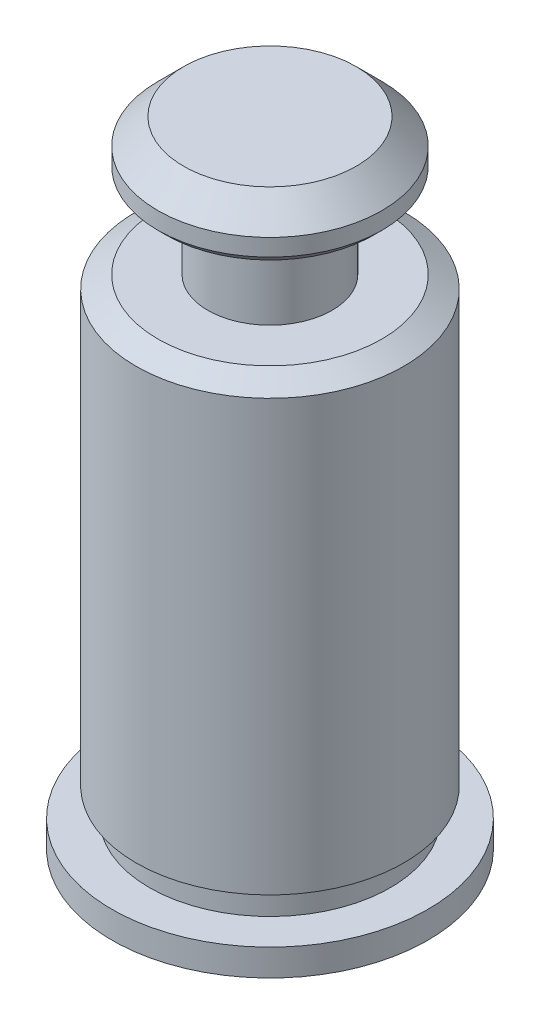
ISO-10303-21;
HEADER;
FILE_DESCRIPTION(('STEP AP214'),'2;1');
FILE_NAME('part.step','',(''),(''),'','','');
FILE_SCHEMA(('AUTOMOTIVE_DESIGN { 1 0 10303 214 1 1 1 1 }'));
ENDSEC;
DATA;
#1=APPLICATION_CONTEXT('core data for automotive mechanical design processes');
#2=APPLICATION_PROTOCOL_DEFINITION('international standard','automotive_design',2000,#1);
#3=PRODUCT_CONTEXT('',#1,'mechanical');
#4=PRODUCT('Part','Part','',(#3));
#5=PRODUCT_RELATED_PRODUCT_CATEGORY('part','',(#4));
#6=PRODUCT_DEFINITION_FORMATION('','',#4);
#7=PRODUCT_DEFINITION_CONTEXT('part definition',#1,'design');
#8=PRODUCT_DEFINITION('design','',#6,#7);
#9=PRODUCT_DEFINITION_SHAPE('','',#8);
#10=(LENGTH_UNIT() NAMED_UNIT(*) SI_UNIT(.MILLI.,.METRE.));
#11=(NAMED_UNIT(*) PLANE_ANGLE_UNIT() SI_UNIT($,.RADIAN.));
#12=(NAMED_UNIT(*) SI_UNIT($,.STERADIAN.) SOLID_ANGLE_UNIT());
#13=UNCERTAINTY_MEASURE_WITH_UNIT(LENGTH_MEASURE(1.E-05),#10,'distance_accuracy_value','');
#14=(GEOMETRIC_REPRESENTATION_CONTEXT(3) GLOBAL_UNCERTAINTY_ASSIGNED_CONTEXT((#13)) GLOBAL_UNIT_ASSIGNED_CONTEXT((#10,
#11,#12)) REPRESENTATION_CONTEXT('',''));
#15=CARTESIAN_POINT('',(0.,0.,0.));
#16=DIRECTION('',(0.,0.,1.));
#17=DIRECTION('',(1.,0.,0.));
#18=AXIS2_PLACEMENT_3D('',#15,#16,#17);
#19=CARTESIAN_POINT('',(0.,0.00507999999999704,0.));
#20=DIRECTION('',(0.,-1.,0.));
#21=DIRECTION('',(0.,0.,-1.));
#22=AXIS2_PLACEMENT_3D('',#19,#20,#21);
#23=PLANE('',#22);
#24=CARTESIAN_POINT('',(0.,0.00507999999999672,0.));
#25=DIRECTION('',(0.,-1.,0.));
#26=DIRECTION('',(0.,0.,-1.));
#27=AXIS2_PLACEMENT_3D('',#24,#25,#26);
#28=CIRCLE('',#27,2.69);
#29=CARTESIAN_POINT('',(0.,0.00507999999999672,-2.69));
#30=VERTEX_POINT('',#29);
#31=EDGE_CURVE('E88',#30,#30,#28,.T.);
#32=ORIENTED_EDGE('',*,*,#31,.T.);
#33=EDGE_LOOP('',(#32));
#34=FACE_BOUND('',#33,.T.);
#35=ADVANCED_FACE('F40',(#34),#23,.T.);
#36=CARTESIAN_POINT('',(1.735,12.75,0.));
#37=DIRECTION('',(0.,1.,0.));
#38=DIRECTION('',(0.,0.,1.));
#39=AXIS2_PLACEMENT_3D('',#36,#37,#38);
#40=PLANE('',#39);
#41=CARTESIAN_POINT('',(0.,12.75,0.));
#42=DIRECTION('',(0.,-1.,0.));
#43=DIRECTION('',(0.,0.,-1.));
#44=AXIS2_PLACEMENT_3D('',#41,#42,#43);
#45=CIRCLE('',#44,1.735);
#46=CARTESIAN_POINT('',(0.,12.75,-1.735));
#47=VERTEX_POINT('',#46);
#48=EDGE_CURVE('E10',#47,#47,#45,.T.);
#49=ORIENTED_EDGE('',*,*,#48,.F.);
#50=EDGE_LOOP('',(#49));
#51=FACE_BOUND('',#50,.T.);
#52=ADVANCED_FACE('F101',(#51),#40,.T.);
#53=CARTESIAN_POINT('',(0.,12.235,0.));
#54=DIRECTION('',(0.,-1.,0.));
#55=DIRECTION('',(0.,0.,-1.));
#56=AXIS2_PLACEMENT_3D('',#53,#54,#55);
#57=CONICAL_SURFACE('',#56,2.25,0.785398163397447);
#58=ORIENTED_EDGE('',*,*,#48,.T.);
#59=EDGE_LOOP('',(#58));
#60=FACE_BOUND('',#59,.T.);
#61=CARTESIAN_POINT('',(0.,12.235,0.));
#62=DIRECTION('',(0.,-1.,0.));
#63=DIRECTION('',(0.,0.,-1.));
#64=AXIS2_PLACEMENT_3D('',#61,#62,#63);
#65=CIRCLE('',#64,2.25);
#66=CARTESIAN_POINT('',(0.,12.235,-2.25));
#67=VERTEX_POINT('',#66);
#68=EDGE_CURVE('E43',#67,#67,#65,.T.);
#69=ORIENTED_EDGE('',*,*,#68,.F.);
#70=EDGE_LOOP('',(#69));
#71=FACE_BOUND('',#70,.T.);
#72=ADVANCED_FACE('F110',(#60,#71),#57,.T.);
#73=CARTESIAN_POINT('',(0.,0.,0.));
#74=DIRECTION('',(0.,-1.,0.));
#75=DIRECTION('',(0.,0.,-1.));
#76=AXIS2_PLACEMENT_3D('',#73,#74,#75);
#77=CYLINDRICAL_SURFACE('',#76,2.25);
#78=ORIENTED_EDGE('',*,*,#68,.T.);
#79=EDGE_LOOP('',(#78));
#80=FACE_BOUND('',#79,.T.);
#81=CARTESIAN_POINT('',(0.,11.8916666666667,0.));
#82=DIRECTION('',(0.,-1.,0.));
#83=DIRECTION('',(0.,0.,-1.));
#84=AXIS2_PLACEMENT_3D('',#81,#82,#83);
#85=CIRCLE('',#84,2.25);
#86=CARTESIAN_POINT('',(0.,11.8916666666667,-2.25));
#87=VERTEX_POINT('',#86);
#88=EDGE_CURVE('E50',#87,#87,#85,.T.);
#89=ORIENTED_EDGE('',*,*,#88,.F.);
#90=EDGE_LOOP('',(#89));
#91=FACE_BOUND('',#90,.T.);
#92=ADVANCED_FACE('F115',(#80,#91),#77,.T.);
#93=CARTESIAN_POINT('',(0.,11.72,0.));
#94=DIRECTION('',(0.,1.,0.));
#95=DIRECTION('',(0.,0.,1.));
#96=AXIS2_PLACEMENT_3D('',#93,#94,#95);
#97=CONICAL_SURFACE('',#96,2.07833333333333,0.785398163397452);
#98=ORIENTED_EDGE('',*,*,#88,.T.);
#99=EDGE_LOOP('',(#98));
#100=FACE_BOUND('',#99,.T.);
#101=CARTESIAN_POINT('',(0.,11.72,0.));
#102=DIRECTION('',(0.,-1.,0.));
#103=DIRECTION('',(0.,0.,-1.));
#104=AXIS2_PLACEMENT_3D('',#101,#102,#103);
#105=CIRCLE('',#104,2.07833333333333);
#106=CARTESIAN_POINT('',(0.,11.72,-2.07833333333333));
#107=VERTEX_POINT('',#106);
#108=EDGE_CURVE('E51',#107,#107,#105,.T.);
#109=ORIENTED_EDGE('',*,*,#108,.F.);
#110=EDGE_LOOP('',(#109));
#111=FACE_BOUND('',#110,.T.);
#112=ADVANCED_FACE('F120',(#100,#111),#97,.T.);
#113=CARTESIAN_POINT('',(1.25,11.72,0.));
#114=DIRECTION('',(0.,-1.,0.));
#115=DIRECTION('',(0.,0.,-1.));
#116=AXIS2_PLACEMENT_3D('',#113,#114,#115);
#117=PLANE('',#116);
#118=ORIENTED_EDGE('',*,*,#108,.T.);
#119=EDGE_LOOP('',(#118));
#120=FACE_BOUND('',#119,.T.);
#121=CARTESIAN_POINT('',(0.,11.72,0.));
#122=DIRECTION('',(0.,-1.,0.));
#123=DIRECTION('',(0.,0.,-1.));
#124=AXIS2_PLACEMENT_3D('',#121,#122,#123);
#125=CIRCLE('',#124,1.25);
#126=CARTESIAN_POINT('',(0.,11.72,-1.25));
#127=VERTEX_POINT('',#126);
#128=EDGE_CURVE('E57',#127,#127,#125,.T.);
#129=ORIENTED_EDGE('',*,*,#128,.F.);
#130=EDGE_LOOP('',(#129));
#131=FACE_BOUND('',#130,.T.);
#132=ADVANCED_FACE('F119',(#120,#131),#117,.T.);
#133=CARTESIAN_POINT('',(0.,0.,0.));
#134=DIRECTION('',(0.,-1.,0.));
#135=DIRECTION('',(0.,0.,-1.));
#136=AXIS2_PLACEMENT_3D('',#133,#134,#135);
#137=CYLINDRICAL_SURFACE('',#136,1.25);
#138=ORIENTED_EDGE('',*,*,#128,.T.);
#139=EDGE_LOOP('',(#138));
#140=FACE_BOUND('',#139,.T.);
#141=CARTESIAN_POINT('',(0.,10.,0.));
#142=DIRECTION('',(0.,-1.,0.));
#143=DIRECTION('',(0.,0.,-1.));
#144=AXIS2_PLACEMENT_3D('',#141,#142,#143);
#145=CIRCLE('',#144,1.25);
#146=CARTESIAN_POINT('',(0.,10.,-1.25));
#147=VERTEX_POINT('',#146);
#148=EDGE_CURVE('E56',#147,#147,#145,.T.);
#149=ORIENTED_EDGE('',*,*,#148,.F.);
#150=EDGE_LOOP('',(#149));
#151=FACE_BOUND('',#150,.T.);
#152=ADVANCED_FACE('F121',(#140,#151),#137,.T.);
#153=CARTESIAN_POINT('',(2.25,10.,0.));
#154=DIRECTION('',(0.,1.,0.));
#155=DIRECTION('',(0.,0.,1.));
#156=AXIS2_PLACEMENT_3D('',#153,#154,#155);
#157=PLANE('',#156);
#158=ORIENTED_EDGE('',*,*,#148,.T.);
#159=EDGE_LOOP('',(#158));
#160=FACE_BOUND('',#159,.T.);
#161=CARTESIAN_POINT('',(0.,10.,0.));
#162=DIRECTION('',(0.,-1.,0.));
#163=DIRECTION('',(0.,0.,-1.));
#164=AXIS2_PLACEMENT_3D('',#161,#162,#163);
#165=CIRCLE('',#164,2.25);
#166=CARTESIAN_POINT('',(0.,10.,-2.25));
#167=VERTEX_POINT('',#166);
#168=EDGE_CURVE('E65',#167,#167,#165,.T.);
#169=ORIENTED_EDGE('',*,*,#168,.F.);
#170=EDGE_LOOP('',(#169));
#171=FACE_BOUND('',#170,.T.);
#172=ADVANCED_FACE('F129',(#160,#171),#157,.T.);
#173=CARTESIAN_POINT('',(0.,9.74596588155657,0.));
#174=DIRECTION('',(0.,-1.,0.));
#175=DIRECTION('',(0.,0.,-1.));
#176=AXIS2_PLACEMENT_3D('',#173,#174,#175);
#177=CONICAL_SURFACE('',#176,2.69,1.0471975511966);
#178=ORIENTED_EDGE('',*,*,#168,.T.);
#179=EDGE_LOOP('',(#178));
#180=FACE_BOUND('',#179,.T.);
#181=CARTESIAN_POINT('',(0.,9.74596588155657,0.));
#182=DIRECTION('',(0.,-1.,0.));
#183=DIRECTION('',(0.,0.,-1.));
#184=AXIS2_PLACEMENT_3D('',#181,#182,#183);
#185=CIRCLE('',#184,2.69);
#186=CARTESIAN_POINT('',(0.,9.74596588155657,-2.69));
#187=VERTEX_POINT('',#186);
#188=EDGE_CURVE('E63',#187,#187,#185,.T.);
#189=ORIENTED_EDGE('',*,*,#188,.F.);
#190=EDGE_LOOP('',(#189));
#191=FACE_BOUND('',#190,.T.);
#192=ADVANCED_FACE('F134',(#180,#191),#177,.T.);
#193=CARTESIAN_POINT('',(0.,0.,0.));
#194=DIRECTION('',(0.,-1.,0.));
#195=DIRECTION('',(0.,0.,-1.));
#196=AXIS2_PLACEMENT_3D('',#193,#194,#195);
#197=CYLINDRICAL_SURFACE('',#196,2.69);
#198=ORIENTED_EDGE('',*,*,#188,.T.);
#199=EDGE_LOOP('',(#198));
#200=FACE_BOUND('',#199,.T.);
#201=CARTESIAN_POINT('',(0.,1.1029,0.));
#202=DIRECTION('',(0.,-1.,0.));
#203=DIRECTION('',(0.,0.,-1.));
#204=AXIS2_PLACEMENT_3D('',#201,#202,#203);
#205=CIRCLE('',#204,2.69);
#206=CARTESIAN_POINT('',(0.,1.1029,-2.69));
#207=VERTEX_POINT('',#206);
#208=EDGE_CURVE('E67',#207,#207,#205,.T.);
#209=ORIENTED_EDGE('',*,*,#208,.F.);
#210=EDGE_LOOP('',(#209));
#211=FACE_BOUND('',#210,.T.);
#212=ADVANCED_FACE('F138',(#200,#211),#197,.T.);
#213=CARTESIAN_POINT('',(2.69,1.1029,0.));
#214=DIRECTION('',(0.,-1.,0.));
#215=DIRECTION('',(0.,0.,-1.));
#216=AXIS2_PLACEMENT_3D('',#213,#214,#215);
#217=PLANE('',#216);
#218=ORIENTED_EDGE('',*,*,#208,.T.);
#219=EDGE_LOOP('',(#218));
#220=FACE_BOUND('',#219,.T.);
#221=CARTESIAN_POINT('',(0.,1.1029,0.));
#222=DIRECTION('',(0.,-1.,0.));
#223=DIRECTION('',(0.,0.,-1.));
#224=AXIS2_PLACEMENT_3D('',#221,#222,#223);
#225=CIRCLE('',#224,2.421);
#226=CARTESIAN_POINT('',(0.,1.1029,-2.421));
#227=VERTEX_POINT('',#226);
#228=EDGE_CURVE('E73',#227,#227,#225,.T.);
#229=ORIENTED_EDGE('',*,*,#228,.F.);
#230=EDGE_LOOP('',(#229));
#231=FACE_BOUND('',#230,.T.);
#232=ADVANCED_FACE('F139',(#220,#231),#217,.T.);
#233=CARTESIAN_POINT('',(0.,0.,0.));
#234=DIRECTION('',(0.,-1.,0.));
#235=DIRECTION('',(0.,0.,-1.));
#236=AXIS2_PLACEMENT_3D('',#233,#234,#235);
#237=CYLINDRICAL_SURFACE('',#236,2.421);
#238=ORIENTED_EDGE('',*,*,#228,.T.);
#239=EDGE_LOOP('',(#238));
#240=FACE_BOUND('',#239,.T.);
#241=CARTESIAN_POINT('',(0.,0.538,0.));
#242=DIRECTION('',(0.,-1.,0.));
#243=DIRECTION('',(0.,0.,-1.));
#244=AXIS2_PLACEMENT_3D('',#241,#242,#243);
#245=CIRCLE('',#244,2.421);
#246=CARTESIAN_POINT('',(0.,0.538,-2.421));
#247=VERTEX_POINT('',#246);
#248=EDGE_CURVE('E72',#247,#247,#245,.T.);
#249=ORIENTED_EDGE('',*,*,#248,.F.);
#250=EDGE_LOOP('',(#249));
#251=FACE_BOUND('',#250,.T.);
#252=ADVANCED_FACE('F144',(#240,#251),#237,.T.);
#253=CARTESIAN_POINT('',(3.175,0.538,0.));
#254=DIRECTION('',(0.,1.,0.));
#255=DIRECTION('',(0.,0.,1.));
#256=AXIS2_PLACEMENT_3D('',#253,#254,#255);
#257=PLANE('',#256);
#258=ORIENTED_EDGE('',*,*,#248,.T.);
#259=EDGE_LOOP('',(#258));
#260=FACE_BOUND('',#259,.T.);
#261=CARTESIAN_POINT('',(0.,0.538,0.));
#262=DIRECTION('',(0.,-1.,0.));
#263=DIRECTION('',(0.,0.,-1.));
#264=AXIS2_PLACEMENT_3D('',#261,#262,#263);
#265=CIRCLE('',#264,3.175);
#266=CARTESIAN_POINT('',(0.,0.538,-3.175));
#267=VERTEX_POINT('',#266);
#268=EDGE_CURVE('E80',#267,#267,#265,.T.);
#269=ORIENTED_EDGE('',*,*,#268,.F.);
#270=EDGE_LOOP('',(#269));
#271=FACE_BOUND('',#270,.T.);
#272=ADVANCED_FACE('F149',(#260,#271),#257,.T.);
#273=CARTESIAN_POINT('',(0.,0.,0.));
#274=DIRECTION('',(0.,-1.,0.));
#275=DIRECTION('',(0.,0.,-1.));
#276=AXIS2_PLACEMENT_3D('',#273,#274,#275);
#277=CYLINDRICAL_SURFACE('',#276,3.175);
#278=ORIENTED_EDGE('',*,*,#268,.T.);
#279=EDGE_LOOP('',(#278));
#280=FACE_BOUND('',#279,.T.);
#281=CARTESIAN_POINT('',(0.,0.,0.));
#282=DIRECTION('',(0.,-1.,0.));
#283=DIRECTION('',(0.,0.,-1.));
#284=AXIS2_PLACEMENT_3D('',#281,#282,#283);
#285=CIRCLE('',#284,3.175);
#286=CARTESIAN_POINT('',(0.,0.,-3.175));
#287=VERTEX_POINT('',#286);
#288=EDGE_CURVE('E78',#287,#287,#285,.T.);
#289=ORIENTED_EDGE('',*,*,#288,.F.);
#290=EDGE_LOOP('',(#289));
#291=FACE_BOUND('',#290,.T.);
#292=ADVANCED_FACE('F100',(#280,#291),#277,.T.);
#293=CARTESIAN_POINT('',(2.69,0.,0.));
#294=DIRECTION('',(0.,-1.,0.));
#295=DIRECTION('',(0.,0.,-1.));
#296=AXIS2_PLACEMENT_3D('',#293,#294,#295);
#297=PLANE('',#296);
#298=ORIENTED_EDGE('',*,*,#288,.T.);
#299=EDGE_LOOP('',(#298));
#300=FACE_BOUND('',#299,.T.);
#301=CARTESIAN_POINT('',(0.,0.,0.));
#302=DIRECTION('',(0.,-1.,0.));
#303=DIRECTION('',(0.,0.,-1.));
#304=AXIS2_PLACEMENT_3D('',#301,#302,#303);
#305=CIRCLE('',#304,2.69);
#306=CARTESIAN_POINT('',(0.,0.,-2.69));
#307=VERTEX_POINT('',#306);
#308=EDGE_CURVE('E84',#307,#307,#305,.T.);
#309=ORIENTED_EDGE('',*,*,#308,.F.);
#310=EDGE_LOOP('',(#309));
#311=FACE_BOUND('',#310,.T.);
#312=ADVANCED_FACE('F91',(#300,#311),#297,.T.);
#313=CARTESIAN_POINT('',(0.,0.,0.));
#314=DIRECTION('',(0.,-1.,0.));
#315=DIRECTION('',(0.,0.,-1.));
#316=AXIS2_PLACEMENT_3D('',#313,#314,#315);
#317=CYLINDRICAL_SURFACE('',#316,2.69);
#318=ORIENTED_EDGE('',*,*,#308,.T.);
#319=EDGE_LOOP('',(#318));
#320=FACE_BOUND('',#319,.T.);
#321=ORIENTED_EDGE('',*,*,#31,.F.);
#322=EDGE_LOOP('',(#321));
#323=FACE_BOUND('',#322,.T.);
#324=ADVANCED_FACE('F93',(#320,#323),#317,.F.);
#325=CLOSED_SHELL('',(#35,#52,#72,#92,#112,#132,#152,#172,#192,#212,#232,#252,#272,#292,#312,#324));
#326=MANIFOLD_SOLID_BREP('B2',#325);
#327=ADVANCED_BREP_SHAPE_REPRESENTATION('',(#18,#326),#14);
#328=SHAPE_DEFINITION_REPRESENTATION(#9,#327);
ENDSEC;
END-ISO-10303-21;
